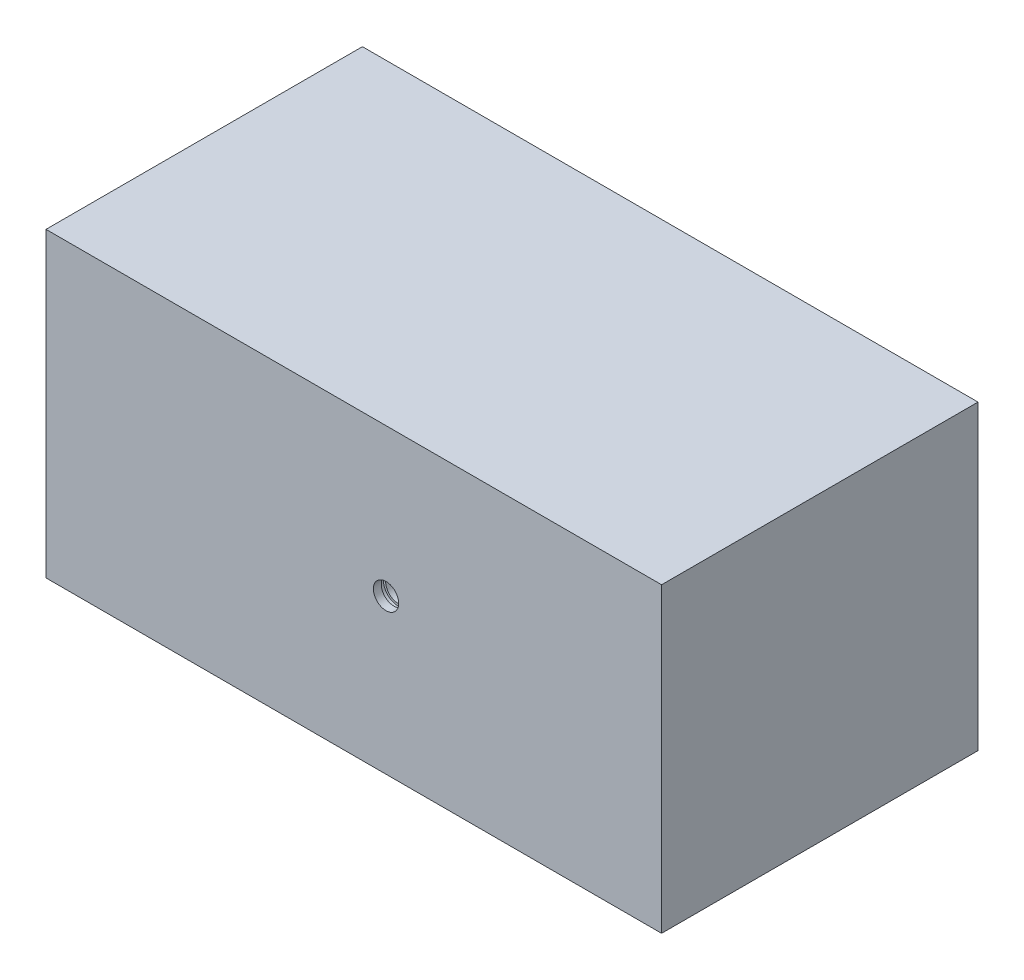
ISO-10303-21;
HEADER;
FILE_DESCRIPTION(('STEP AP214'),'2;1');
FILE_NAME('part.step','',(''),(''),'','','');
FILE_SCHEMA(('AUTOMOTIVE_DESIGN { 1 0 10303 214 1 1 1 1 }'));
ENDSEC;
DATA;
#1=APPLICATION_CONTEXT('core data for automotive mechanical design processes');
#2=APPLICATION_PROTOCOL_DEFINITION('international standard','automotive_design',2000,#1);
#3=PRODUCT_CONTEXT('',#1,'mechanical');
#4=PRODUCT('Part','Part','',(#3));
#5=PRODUCT_RELATED_PRODUCT_CATEGORY('part','',(#4));
#6=PRODUCT_DEFINITION_FORMATION('','',#4);
#7=PRODUCT_DEFINITION_CONTEXT('part definition',#1,'design');
#8=PRODUCT_DEFINITION('design','',#6,#7);
#9=PRODUCT_DEFINITION_SHAPE('','',#8);
#10=(LENGTH_UNIT() NAMED_UNIT(*) SI_UNIT(.MILLI.,.METRE.));
#11=(NAMED_UNIT(*) PLANE_ANGLE_UNIT() SI_UNIT($,.RADIAN.));
#12=(NAMED_UNIT(*) SI_UNIT($,.STERADIAN.) SOLID_ANGLE_UNIT());
#13=UNCERTAINTY_MEASURE_WITH_UNIT(LENGTH_MEASURE(1.E-05),#10,'distance_accuracy_value','');
#14=(GEOMETRIC_REPRESENTATION_CONTEXT(3) GLOBAL_UNCERTAINTY_ASSIGNED_CONTEXT((#13)) GLOBAL_UNIT_ASSIGNED_CONTEXT((#10,
#11,#12)) REPRESENTATION_CONTEXT('',''));
#15=CARTESIAN_POINT('',(0.,0.,0.));
#16=DIRECTION('',(0.,0.,1.));
#17=DIRECTION('',(1.,0.,0.));
#18=AXIS2_PLACEMENT_3D('',#15,#16,#17);
#19=CARTESIAN_POINT('',(53.7286551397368,24.382542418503,50.));
#20=DIRECTION('',(0.,0.,1.));
#21=DIRECTION('',(1.,0.,0.));
#22=AXIS2_PLACEMENT_3D('',#19,#20,#21);
#23=CYLINDRICAL_SURFACE('',#22,1.99999999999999);
#24=CARTESIAN_POINT('',(53.7286551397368,24.382542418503,48.7522566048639));
#25=DIRECTION('',(0.,0.,1.));
#26=DIRECTION('',(1.,0.,0.));
#27=AXIS2_PLACEMENT_3D('',#24,#25,#26);
#28=CIRCLE('',#27,1.99999999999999);
#29=CARTESIAN_POINT('',(55.7286551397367,24.382542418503,48.7522566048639));
#30=VERTEX_POINT('',#29);
#31=EDGE_CURVE('E39',#30,#30,#28,.F.);
#32=ORIENTED_EDGE('',*,*,#31,.T.);
#33=EDGE_LOOP('',(#32));
#34=FACE_BOUND('',#33,.T.);
#35=CARTESIAN_POINT('',(53.7286551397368,24.382542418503,50.));
#36=DIRECTION('',(0.,0.,1.));
#37=DIRECTION('',(1.,0.,0.));
#38=AXIS2_PLACEMENT_3D('',#35,#36,#37);
#39=CIRCLE('',#38,1.99999999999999);
#40=CARTESIAN_POINT('',(55.7286551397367,24.382542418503,50.));
#41=VERTEX_POINT('',#40);
#42=EDGE_CURVE('E100',#41,#41,#39,.T.);
#43=ORIENTED_EDGE('',*,*,#42,.T.);
#44=EDGE_LOOP('',(#43));
#45=FACE_BOUND('',#44,.T.);
#46=ADVANCED_FACE('F35',(#34,#45),#23,.F.);
#47=CARTESIAN_POINT('',(0.,0.,50.));
#48=DIRECTION('',(1.,0.,0.));
#49=DIRECTION('',(0.,0.,-1.));
#50=AXIS2_PLACEMENT_3D('',#47,#48,#49);
#51=PLANE('',#50);
#52=DIRECTION('',(0.,-1.,0.));
#53=VECTOR('',#52,1.);
#54=CARTESIAN_POINT('',(0.,0.,0.));
#55=LINE('',#54,#53);
#56=CARTESIAN_POINT('',(0.,47.7051767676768,0.));
#57=VERTEX_POINT('',#56);
#58=CARTESIAN_POINT('',(0.,0.,0.));
#59=VERTEX_POINT('',#58);
#60=EDGE_CURVE('E99',#57,#59,#55,.T.);
#61=ORIENTED_EDGE('',*,*,#60,.T.);
#62=DIRECTION('',(0.,0.,-1.));
#63=VECTOR('',#62,1.);
#64=CARTESIAN_POINT('',(0.,0.,50.));
#65=LINE('',#64,#63);
#66=CARTESIAN_POINT('',(0.,0.,50.));
#67=VERTEX_POINT('',#66);
#68=EDGE_CURVE('E11',#67,#59,#65,.T.);
#69=ORIENTED_EDGE('',*,*,#68,.F.);
#70=DIRECTION('',(0.,-1.,0.));
#71=VECTOR('',#70,1.);
#72=CARTESIAN_POINT('',(0.,0.,50.));
#73=LINE('',#72,#71);
#74=CARTESIAN_POINT('',(0.,47.7051767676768,50.));
#75=VERTEX_POINT('',#74);
#76=EDGE_CURVE('E109',#75,#67,#73,.T.);
#77=ORIENTED_EDGE('',*,*,#76,.F.);
#78=DIRECTION('',(0.,0.,-1.));
#79=VECTOR('',#78,1.);
#80=CARTESIAN_POINT('',(0.,47.7051767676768,50.));
#81=LINE('',#80,#79);
#82=EDGE_CURVE('E114',#75,#57,#81,.T.);
#83=ORIENTED_EDGE('',*,*,#82,.T.);
#84=EDGE_LOOP('',(#61,#69,#77,#83));
#85=FACE_BOUND('',#84,.T.);
#86=ADVANCED_FACE('F37',(#85),#51,.F.);
#87=CARTESIAN_POINT('',(0.,0.,50.));
#88=DIRECTION('',(0.,1.,0.));
#89=DIRECTION('',(0.,0.,1.));
#90=AXIS2_PLACEMENT_3D('',#87,#88,#89);
#91=PLANE('',#90);
#92=DIRECTION('',(1.,0.,0.));
#93=VECTOR('',#92,1.);
#94=CARTESIAN_POINT('',(0.,0.,0.));
#95=LINE('',#94,#93);
#96=CARTESIAN_POINT('',(97.2758554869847,0.,0.));
#97=VERTEX_POINT('',#96);
#98=EDGE_CURVE('E103',#59,#97,#95,.T.);
#99=ORIENTED_EDGE('',*,*,#98,.T.);
#100=DIRECTION('',(0.,0.,-1.));
#101=VECTOR('',#100,1.);
#102=CARTESIAN_POINT('',(97.2758554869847,0.,50.));
#103=LINE('',#102,#101);
#104=CARTESIAN_POINT('',(97.2758554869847,0.,50.));
#105=VERTEX_POINT('',#104);
#106=EDGE_CURVE('E45',#105,#97,#103,.T.);
#107=ORIENTED_EDGE('',*,*,#106,.F.);
#108=DIRECTION('',(1.,0.,0.));
#109=VECTOR('',#108,1.);
#110=CARTESIAN_POINT('',(0.,0.,50.));
#111=LINE('',#110,#109);
#112=EDGE_CURVE('E85',#67,#105,#111,.T.);
#113=ORIENTED_EDGE('',*,*,#112,.F.);
#114=ORIENTED_EDGE('',*,*,#68,.T.);
#115=EDGE_LOOP('',(#99,#107,#113,#114));
#116=FACE_BOUND('',#115,.T.);
#117=ADVANCED_FACE('F153',(#116),#91,.F.);
#118=CARTESIAN_POINT('',(97.2758554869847,0.,50.));
#119=DIRECTION('',(-1.,0.,0.));
#120=DIRECTION('',(0.,0.,1.));
#121=AXIS2_PLACEMENT_3D('',#118,#119,#120);
#122=PLANE('',#121);
#123=DIRECTION('',(0.,1.,0.));
#124=VECTOR('',#123,1.);
#125=CARTESIAN_POINT('',(97.2758554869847,0.,0.));
#126=LINE('',#125,#124);
#127=CARTESIAN_POINT('',(97.2758554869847,47.7051767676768,0.));
#128=VERTEX_POINT('',#127);
#129=EDGE_CURVE('E72',#97,#128,#126,.T.);
#130=ORIENTED_EDGE('',*,*,#129,.T.);
#131=DIRECTION('',(0.,0.,-1.));
#132=VECTOR('',#131,1.);
#133=CARTESIAN_POINT('',(97.2758554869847,47.7051767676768,50.));
#134=LINE('',#133,#132);
#135=CARTESIAN_POINT('',(97.2758554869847,47.7051767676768,50.));
#136=VERTEX_POINT('',#135);
#137=EDGE_CURVE('E120',#136,#128,#134,.T.);
#138=ORIENTED_EDGE('',*,*,#137,.F.);
#139=DIRECTION('',(0.,1.,0.));
#140=VECTOR('',#139,1.);
#141=CARTESIAN_POINT('',(97.2758554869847,0.,50.));
#142=LINE('',#141,#140);
#143=EDGE_CURVE('E112',#105,#136,#142,.T.);
#144=ORIENTED_EDGE('',*,*,#143,.F.);
#145=ORIENTED_EDGE('',*,*,#106,.T.);
#146=EDGE_LOOP('',(#130,#138,#144,#145));
#147=FACE_BOUND('',#146,.T.);
#148=ADVANCED_FACE('F210',(#147),#122,.F.);
#149=CARTESIAN_POINT('',(0.,47.7051767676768,50.));
#150=DIRECTION('',(0.,-1.,0.));
#151=DIRECTION('',(0.,0.,-1.));
#152=AXIS2_PLACEMENT_3D('',#149,#150,#151);
#153=PLANE('',#152);
#154=DIRECTION('',(-1.,0.,0.));
#155=VECTOR('',#154,1.);
#156=CARTESIAN_POINT('',(0.,47.7051767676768,0.));
#157=LINE('',#156,#155);
#158=EDGE_CURVE('E78',#128,#57,#157,.T.);
#159=ORIENTED_EDGE('',*,*,#158,.T.);
#160=ORIENTED_EDGE('',*,*,#82,.F.);
#161=DIRECTION('',(-1.,0.,0.));
#162=VECTOR('',#161,1.);
#163=CARTESIAN_POINT('',(0.,47.7051767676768,50.));
#164=LINE('',#163,#162);
#165=EDGE_CURVE('E54',#136,#75,#164,.T.);
#166=ORIENTED_EDGE('',*,*,#165,.F.);
#167=ORIENTED_EDGE('',*,*,#137,.T.);
#168=EDGE_LOOP('',(#159,#160,#166,#167));
#169=FACE_BOUND('',#168,.T.);
#170=ADVANCED_FACE('F205',(#169),#153,.F.);
#171=CARTESIAN_POINT('',(0.,47.7051767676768,50.));
#172=DIRECTION('',(0.,0.,-1.));
#173=DIRECTION('',(-1.,0.,0.));
#174=AXIS2_PLACEMENT_3D('',#171,#172,#173);
#175=PLANE('',#174);
#176=ORIENTED_EDGE('',*,*,#42,.F.);
#177=EDGE_LOOP('',(#176));
#178=FACE_BOUND('',#177,.T.);
#179=ORIENTED_EDGE('',*,*,#76,.T.);
#180=ORIENTED_EDGE('',*,*,#112,.T.);
#181=ORIENTED_EDGE('',*,*,#143,.T.);
#182=ORIENTED_EDGE('',*,*,#165,.T.);
#183=EDGE_LOOP('',(#179,#180,#181,#182));
#184=FACE_BOUND('',#183,.T.);
#185=ADVANCED_FACE('F170',(#178,#184),#175,.F.);
#186=CARTESIAN_POINT('',(0.,47.7051767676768,0.));
#187=DIRECTION('',(0.,0.,-1.));
#188=DIRECTION('',(-1.,0.,0.));
#189=AXIS2_PLACEMENT_3D('',#186,#187,#188);
#190=PLANE('',#189);
#191=ORIENTED_EDGE('',*,*,#60,.F.);
#192=ORIENTED_EDGE('',*,*,#158,.F.);
#193=ORIENTED_EDGE('',*,*,#129,.F.);
#194=ORIENTED_EDGE('',*,*,#98,.F.);
#195=EDGE_LOOP('',(#191,#192,#193,#194));
#196=FACE_BOUND('',#195,.T.);
#197=ADVANCED_FACE('F184',(#196),#190,.T.);
#198=CARTESIAN_POINT('',(53.7286551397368,26.7320977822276,48.7522566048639));
#199=DIRECTION('',(0.,0.,1.));
#200=DIRECTION('',(1.,0.,0.));
#201=AXIS2_PLACEMENT_3D('',#198,#199,#200);
#202=PLANE('',#201);
#203=CARTESIAN_POINT('',(53.7286551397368,24.382542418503,48.7522566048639));
#204=DIRECTION('',(0.,0.,-1.));
#205=DIRECTION('',(-1.,0.,0.));
#206=AXIS2_PLACEMENT_3D('',#203,#204,#205);
#207=CIRCLE('',#206,2.34955536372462);
#208=CARTESIAN_POINT('',(51.3790997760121,24.382542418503,48.7522566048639));
#209=VERTEX_POINT('',#208);
#210=EDGE_CURVE('E129',#209,#209,#207,.T.);
#211=ORIENTED_EDGE('',*,*,#210,.T.);
#212=EDGE_LOOP('',(#211));
#213=FACE_BOUND('',#212,.T.);
#214=ORIENTED_EDGE('',*,*,#31,.F.);
#215=EDGE_LOOP('',(#214));
#216=FACE_BOUND('',#215,.T.);
#217=ADVANCED_FACE('F136',(#213,#216),#202,.F.);
#218=CARTESIAN_POINT('',(53.7286551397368,26.7320977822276,48.0590441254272));
#219=DIRECTION('',(0.,0.,-1.));
#220=DIRECTION('',(-1.,0.,0.));
#221=AXIS2_PLACEMENT_3D('',#218,#219,#220);
#222=PLANE('',#221);
#223=CARTESIAN_POINT('',(53.7286551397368,24.382542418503,48.0590441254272));
#224=DIRECTION('',(0.,0.,-1.));
#225=DIRECTION('',(-1.,0.,0.));
#226=AXIS2_PLACEMENT_3D('',#223,#224,#225);
#227=CIRCLE('',#226,2.34955536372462);
#228=CARTESIAN_POINT('',(51.3790997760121,24.382542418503,48.0590441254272));
#229=VERTEX_POINT('',#228);
#230=EDGE_CURVE('E124',#229,#229,#227,.T.);
#231=ORIENTED_EDGE('',*,*,#230,.F.);
#232=EDGE_LOOP('',(#231));
#233=FACE_BOUND('',#232,.T.);
#234=CARTESIAN_POINT('',(53.7286551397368,24.382542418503,48.0590441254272));
#235=DIRECTION('',(0.,0.,-1.));
#236=DIRECTION('',(-1.,0.,0.));
#237=AXIS2_PLACEMENT_3D('',#234,#235,#236);
#238=CIRCLE('',#237,1.99999999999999);
#239=CARTESIAN_POINT('',(51.7286551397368,24.382542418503,48.0590441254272));
#240=VERTEX_POINT('',#239);
#241=EDGE_CURVE('E122',#240,#240,#238,.F.);
#242=ORIENTED_EDGE('',*,*,#241,.F.);
#243=EDGE_LOOP('',(#242));
#244=FACE_BOUND('',#243,.T.);
#245=ADVANCED_FACE('F140',(#233,#244),#222,.F.);
#246=CARTESIAN_POINT('',(53.7286551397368,24.382542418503,36.));
#247=DIRECTION('',(0.,0.,-1.));
#248=DIRECTION('',(-1.,0.,0.));
#249=AXIS2_PLACEMENT_3D('',#246,#247,#248);
#250=CYLINDRICAL_SURFACE('',#249,2.34955536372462);
#251=ORIENTED_EDGE('',*,*,#210,.F.);
#252=EDGE_LOOP('',(#251));
#253=FACE_BOUND('',#252,.T.);
#254=ORIENTED_EDGE('',*,*,#230,.T.);
#255=EDGE_LOOP('',(#254));
#256=FACE_BOUND('',#255,.T.);
#257=ADVANCED_FACE('F93',(#253,#256),#250,.F.);
#258=CARTESIAN_POINT('',(53.7286551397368,24.382542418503,36.));
#259=DIRECTION('',(0.,0.,1.));
#260=DIRECTION('',(1.,0.,0.));
#261=AXIS2_PLACEMENT_3D('',#258,#259,#260);
#262=CONICAL_SURFACE('',#261,1.99999999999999,1.02974425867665);
#263=CARTESIAN_POINT('',(53.7286551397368,24.382542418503,34.7982787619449));
#264=VERTEX_POINT('',#263);
#265=VERTEX_LOOP('',#264);
#266=FACE_BOUND('',#265,.T.);
#267=CARTESIAN_POINT('',(53.7286551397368,24.382542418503,36.));
#268=DIRECTION('',(0.,0.,1.));
#269=DIRECTION('',(1.,0.,0.));
#270=AXIS2_PLACEMENT_3D('',#267,#268,#269);
#271=CIRCLE('',#270,1.99999999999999);
#272=CARTESIAN_POINT('',(55.7286551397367,24.382542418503,36.));
#273=VERTEX_POINT('',#272);
#274=EDGE_CURVE('E97',#273,#273,#271,.T.);
#275=ORIENTED_EDGE('',*,*,#274,.T.);
#276=EDGE_LOOP('',(#275));
#277=FACE_BOUND('',#276,.T.);
#278=ADVANCED_FACE('F89',(#266,#277),#262,.F.);
#279=ORIENTED_EDGE('',*,*,#241,.T.);
#280=EDGE_LOOP('',(#279));
#281=FACE_BOUND('',#280,.T.);
#282=ORIENTED_EDGE('',*,*,#274,.F.);
#283=EDGE_LOOP('',(#282));
#284=FACE_BOUND('',#283,.T.);
#285=ADVANCED_FACE('F92',(#281,#284),#23,.F.);
#286=CLOSED_SHELL('',(#46,#86,#117,#148,#170,#185,#197,#217,#245,#257,#278,#285));
#287=MANIFOLD_SOLID_BREP('B2',#286);
#288=ADVANCED_BREP_SHAPE_REPRESENTATION('',(#18,#287),#14);
#289=SHAPE_DEFINITION_REPRESENTATION(#9,#288);
ENDSEC;
END-ISO-10303-21;
